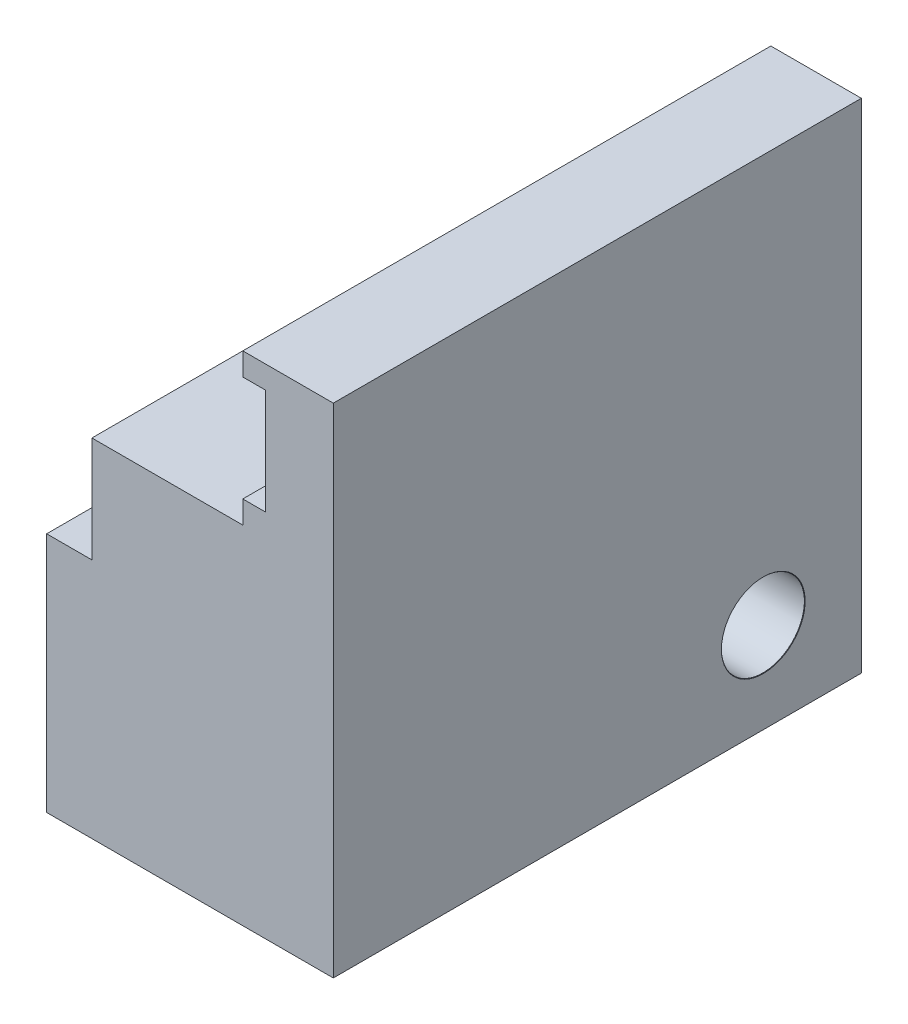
ISO-10303-21;
HEADER;
FILE_DESCRIPTION(('STEP AP214'),'2;1');
FILE_NAME('part.step','',(''),(''),'','','');
FILE_SCHEMA(('AUTOMOTIVE_DESIGN { 1 0 10303 214 1 1 1 1 }'));
ENDSEC;
DATA;
#1=APPLICATION_CONTEXT('core data for automotive mechanical design processes');
#2=APPLICATION_PROTOCOL_DEFINITION('international standard','automotive_design',2000,#1);
#3=PRODUCT_CONTEXT('',#1,'mechanical');
#4=PRODUCT('Part','Part','',(#3));
#5=PRODUCT_RELATED_PRODUCT_CATEGORY('part','',(#4));
#6=PRODUCT_DEFINITION_FORMATION('','',#4);
#7=PRODUCT_DEFINITION_CONTEXT('part definition',#1,'design');
#8=PRODUCT_DEFINITION('design','',#6,#7);
#9=PRODUCT_DEFINITION_SHAPE('','',#8);
#10=(LENGTH_UNIT() NAMED_UNIT(*) SI_UNIT(.MILLI.,.METRE.));
#11=(NAMED_UNIT(*) PLANE_ANGLE_UNIT() SI_UNIT($,.RADIAN.));
#12=(NAMED_UNIT(*) SI_UNIT($,.STERADIAN.) SOLID_ANGLE_UNIT());
#13=UNCERTAINTY_MEASURE_WITH_UNIT(LENGTH_MEASURE(1.E-05),#10,'distance_accuracy_value','');
#14=(GEOMETRIC_REPRESENTATION_CONTEXT(3) GLOBAL_UNCERTAINTY_ASSIGNED_CONTEXT((#13)) GLOBAL_UNIT_ASSIGNED_CONTEXT((#10,
#11,#12)) REPRESENTATION_CONTEXT('',''));
#15=CARTESIAN_POINT('',(0.,0.,0.));
#16=DIRECTION('',(0.,0.,1.));
#17=DIRECTION('',(1.,0.,0.));
#18=AXIS2_PLACEMENT_3D('',#15,#16,#17);
#19=CARTESIAN_POINT('',(-159.,218.05458814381,35.));
#20=DIRECTION('',(-1.,0.,0.));
#21=DIRECTION('',(0.,0.,1.));
#22=AXIS2_PLACEMENT_3D('',#19,#20,#21);
#23=PLANE('',#22);
#24=CARTESIAN_POINT('',(-159.,224.05458814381,6.5));
#25=DIRECTION('',(-1.,0.,0.));
#26=DIRECTION('',(0.,0.,1.));
#27=AXIS2_PLACEMENT_3D('',#24,#25,#26);
#28=CIRCLE('',#27,2.775);
#29=CARTESIAN_POINT('',(-159.,224.05458814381,9.275));
#30=VERTEX_POINT('',#29);
#31=EDGE_CURVE('E249',#30,#30,#28,.T.);
#32=ORIENTED_EDGE('',*,*,#31,.T.);
#33=EDGE_LOOP('',(#32));
#34=FACE_BOUND('',#33,.T.);
#35=DIRECTION('',(0.,1.,0.));
#36=VECTOR('',#35,1.);
#37=CARTESIAN_POINT('',(-159.,218.05458814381,0.));
#38=LINE('',#37,#36);
#39=CARTESIAN_POINT('',(-159.,218.05458814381,0.));
#40=VERTEX_POINT('',#39);
#41=CARTESIAN_POINT('',(-159.,251.054588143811,0.));
#42=VERTEX_POINT('',#41);
#43=EDGE_CURVE('E163',#40,#42,#38,.T.);
#44=ORIENTED_EDGE('',*,*,#43,.T.);
#45=DIRECTION('',(0.,0.,-1.));
#46=VECTOR('',#45,1.);
#47=CARTESIAN_POINT('',(-159.,251.054588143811,35.));
#48=LINE('',#47,#46);
#49=CARTESIAN_POINT('',(-159.,251.054588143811,35.));
#50=VERTEX_POINT('',#49);
#51=EDGE_CURVE('E11',#50,#42,#48,.T.);
#52=ORIENTED_EDGE('',*,*,#51,.F.);
#53=DIRECTION('',(0.,1.,0.));
#54=VECTOR('',#53,1.);
#55=CARTESIAN_POINT('',(-159.,218.05458814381,35.));
#56=LINE('',#55,#54);
#57=CARTESIAN_POINT('',(-159.,218.05458814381,35.));
#58=VERTEX_POINT('',#57);
#59=EDGE_CURVE('E171',#58,#50,#56,.T.);
#60=ORIENTED_EDGE('',*,*,#59,.F.);
#61=DIRECTION('',(0.,0.,-1.));
#62=VECTOR('',#61,1.);
#63=CARTESIAN_POINT('',(-159.,218.05458814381,35.));
#64=LINE('',#63,#62);
#65=EDGE_CURVE('E184',#58,#40,#64,.T.);
#66=ORIENTED_EDGE('',*,*,#65,.T.);
#67=EDGE_LOOP('',(#44,#52,#60,#66));
#68=FACE_BOUND('',#67,.T.);
#69=ADVANCED_FACE('F16',(#34,#68),#23,.F.);
#70=CARTESIAN_POINT('',(-159.,251.054588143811,35.));
#71=DIRECTION('',(0.,-1.,0.));
#72=DIRECTION('',(0.,0.,-1.));
#73=AXIS2_PLACEMENT_3D('',#70,#71,#72);
#74=PLANE('',#73);
#75=DIRECTION('',(-1.,0.,0.));
#76=VECTOR('',#75,1.);
#77=CARTESIAN_POINT('',(-159.,251.054588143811,0.));
#78=LINE('',#77,#76);
#79=CARTESIAN_POINT('',(-165.,251.054588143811,0.));
#80=VERTEX_POINT('',#79);
#81=EDGE_CURVE('E187',#42,#80,#78,.T.);
#82=ORIENTED_EDGE('',*,*,#81,.T.);
#83=DIRECTION('',(0.,0.,-1.));
#84=VECTOR('',#83,1.);
#85=CARTESIAN_POINT('',(-165.,251.054588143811,35.));
#86=LINE('',#85,#84);
#87=CARTESIAN_POINT('',(-165.,251.054588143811,35.));
#88=VERTEX_POINT('',#87);
#89=EDGE_CURVE('E23',#88,#80,#86,.T.);
#90=ORIENTED_EDGE('',*,*,#89,.F.);
#91=DIRECTION('',(-1.,0.,0.));
#92=VECTOR('',#91,1.);
#93=CARTESIAN_POINT('',(-159.,251.054588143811,35.));
#94=LINE('',#93,#92);
#95=EDGE_CURVE('E174',#50,#88,#94,.T.);
#96=ORIENTED_EDGE('',*,*,#95,.F.);
#97=ORIENTED_EDGE('',*,*,#51,.T.);
#98=EDGE_LOOP('',(#82,#90,#96,#97));
#99=FACE_BOUND('',#98,.T.);
#100=ADVANCED_FACE('F219',(#99),#74,.F.);
#101=CARTESIAN_POINT('',(-165.,251.054588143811,35.));
#102=DIRECTION('',(1.,0.,0.));
#103=DIRECTION('',(0.,0.,-1.));
#104=AXIS2_PLACEMENT_3D('',#101,#102,#103);
#105=PLANE('',#104);
#106=DIRECTION('',(0.,-1.,0.));
#107=VECTOR('',#106,1.);
#108=CARTESIAN_POINT('',(-165.,251.054588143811,0.));
#109=LINE('',#108,#107);
#110=CARTESIAN_POINT('',(-165.,249.55458814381,0.));
#111=VERTEX_POINT('',#110);
#112=EDGE_CURVE('E189',#80,#111,#109,.T.);
#113=ORIENTED_EDGE('',*,*,#112,.T.);
#114=DIRECTION('',(0.,0.,-1.));
#115=VECTOR('',#114,1.);
#116=CARTESIAN_POINT('',(-165.,249.55458814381,35.));
#117=LINE('',#116,#115);
#118=CARTESIAN_POINT('',(-165.,249.55458814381,35.));
#119=VERTEX_POINT('',#118);
#120=EDGE_CURVE('E38',#119,#111,#117,.T.);
#121=ORIENTED_EDGE('',*,*,#120,.F.);
#122=DIRECTION('',(0.,-1.,0.));
#123=VECTOR('',#122,1.);
#124=CARTESIAN_POINT('',(-165.,251.054588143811,35.));
#125=LINE('',#124,#123);
#126=EDGE_CURVE('E177',#88,#119,#125,.T.);
#127=ORIENTED_EDGE('',*,*,#126,.F.);
#128=ORIENTED_EDGE('',*,*,#89,.T.);
#129=EDGE_LOOP('',(#113,#121,#127,#128));
#130=FACE_BOUND('',#129,.T.);
#131=ADVANCED_FACE('F204',(#130),#105,.F.);
#132=CARTESIAN_POINT('',(-178.,218.05458814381,35.));
#133=DIRECTION('',(1.,0.,0.));
#134=DIRECTION('',(0.,0.,-1.));
#135=AXIS2_PLACEMENT_3D('',#132,#133,#134);
#136=PLANE('',#135);
#137=CARTESIAN_POINT('',(-178.,224.05458814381,6.5));
#138=DIRECTION('',(-1.,0.,0.));
#139=DIRECTION('',(0.,0.,1.));
#140=AXIS2_PLACEMENT_3D('',#137,#138,#139);
#141=CIRCLE('',#140,5.025);
#142=CARTESIAN_POINT('',(-178.,224.05458814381,11.525));
#143=VERTEX_POINT('',#142);
#144=EDGE_CURVE('E251',#143,#143,#141,.T.);
#145=ORIENTED_EDGE('',*,*,#144,.F.);
#146=EDGE_LOOP('',(#145));
#147=FACE_BOUND('',#146,.T.);
#148=DIRECTION('',(0.,-1.,0.));
#149=VECTOR('',#148,1.);
#150=CARTESIAN_POINT('',(-178.,218.05458814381,35.));
#151=LINE('',#150,#149);
#152=CARTESIAN_POINT('',(-178.,234.05458814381,35.));
#153=VERTEX_POINT('',#152);
#154=CARTESIAN_POINT('',(-178.,218.05458814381,35.));
#155=VERTEX_POINT('',#154);
#156=EDGE_CURVE('E180',#153,#155,#151,.T.);
#157=ORIENTED_EDGE('',*,*,#156,.F.);
#158=DIRECTION('',(0.,0.,-1.));
#159=VECTOR('',#158,1.);
#160=CARTESIAN_POINT('',(-178.,234.05458814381,35.));
#161=LINE('',#160,#159);
#162=CARTESIAN_POINT('',(-178.,234.05458814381,0.));
#163=VERTEX_POINT('',#162);
#164=EDGE_CURVE('E110',#153,#163,#161,.T.);
#165=ORIENTED_EDGE('',*,*,#164,.T.);
#166=DIRECTION('',(0.,-1.,0.));
#167=VECTOR('',#166,1.);
#168=CARTESIAN_POINT('',(-178.,218.05458814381,0.));
#169=LINE('',#168,#167);
#170=CARTESIAN_POINT('',(-178.,218.05458814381,0.));
#171=VERTEX_POINT('',#170);
#172=EDGE_CURVE('E192',#163,#171,#169,.T.);
#173=ORIENTED_EDGE('',*,*,#172,.T.);
#174=DIRECTION('',(0.,0.,-1.));
#175=VECTOR('',#174,1.);
#176=CARTESIAN_POINT('',(-178.,218.05458814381,35.));
#177=LINE('',#176,#175);
#178=EDGE_CURVE('E197',#155,#171,#177,.T.);
#179=ORIENTED_EDGE('',*,*,#178,.F.);
#180=EDGE_LOOP('',(#157,#165,#173,#179));
#181=FACE_BOUND('',#180,.T.);
#182=ADVANCED_FACE('F228',(#147,#181),#136,.F.);
#183=CARTESIAN_POINT('',(-159.,218.05458814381,35.));
#184=DIRECTION('',(0.,1.,0.));
#185=DIRECTION('',(0.,0.,1.));
#186=AXIS2_PLACEMENT_3D('',#183,#184,#185);
#187=PLANE('',#186);
#188=DIRECTION('',(1.,0.,0.));
#189=VECTOR('',#188,1.);
#190=CARTESIAN_POINT('',(-159.,218.05458814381,0.));
#191=LINE('',#190,#189);
#192=EDGE_CURVE('E175',#171,#40,#191,.T.);
#193=ORIENTED_EDGE('',*,*,#192,.T.);
#194=ORIENTED_EDGE('',*,*,#65,.F.);
#195=DIRECTION('',(1.,0.,0.));
#196=VECTOR('',#195,1.);
#197=CARTESIAN_POINT('',(-159.,218.05458814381,35.));
#198=LINE('',#197,#196);
#199=EDGE_CURVE('E182',#155,#58,#198,.T.);
#200=ORIENTED_EDGE('',*,*,#199,.F.);
#201=ORIENTED_EDGE('',*,*,#178,.T.);
#202=EDGE_LOOP('',(#193,#194,#200,#201));
#203=FACE_BOUND('',#202,.T.);
#204=ADVANCED_FACE('F224',(#203),#187,.F.);
#205=CARTESIAN_POINT('',(0.,0.,35.));
#206=DIRECTION('',(0.,0.,1.));
#207=DIRECTION('',(1.,0.,0.));
#208=AXIS2_PLACEMENT_3D('',#205,#206,#207);
#209=PLANE('',#208);
#210=DIRECTION('',(-1.,0.,0.));
#211=VECTOR('',#210,1.);
#212=CARTESIAN_POINT('',(-178.,234.05458814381,35.));
#213=LINE('',#212,#211);
#214=CARTESIAN_POINT('',(-175.,234.05458814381,35.));
#215=VERTEX_POINT('',#214);
#216=EDGE_CURVE('E114',#215,#153,#213,.T.);
#217=ORIENTED_EDGE('',*,*,#216,.T.);
#218=ORIENTED_EDGE('',*,*,#156,.T.);
#219=ORIENTED_EDGE('',*,*,#199,.T.);
#220=ORIENTED_EDGE('',*,*,#59,.T.);
#221=ORIENTED_EDGE('',*,*,#95,.T.);
#222=ORIENTED_EDGE('',*,*,#126,.T.);
#223=DIRECTION('',(1.,0.,0.));
#224=VECTOR('',#223,1.);
#225=CARTESIAN_POINT('',(-163.5,249.55458814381,35.));
#226=LINE('',#225,#224);
#227=CARTESIAN_POINT('',(-163.5,249.55458814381,35.));
#228=VERTEX_POINT('',#227);
#229=EDGE_CURVE('E136',#119,#228,#226,.T.);
#230=ORIENTED_EDGE('',*,*,#229,.T.);
#231=DIRECTION('',(0.,-1.,0.));
#232=VECTOR('',#231,1.);
#233=CARTESIAN_POINT('',(-163.5,242.55458814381,35.));
#234=LINE('',#233,#232);
#235=CARTESIAN_POINT('',(-163.5,242.55458814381,35.));
#236=VERTEX_POINT('',#235);
#237=EDGE_CURVE('E139',#228,#236,#234,.T.);
#238=ORIENTED_EDGE('',*,*,#237,.T.);
#239=DIRECTION('',(-1.,0.,0.));
#240=VECTOR('',#239,1.);
#241=CARTESIAN_POINT('',(-163.5,242.55458814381,35.));
#242=LINE('',#241,#240);
#243=CARTESIAN_POINT('',(-165.,242.55458814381,35.));
#244=VERTEX_POINT('',#243);
#245=EDGE_CURVE('E143',#236,#244,#242,.T.);
#246=ORIENTED_EDGE('',*,*,#245,.T.);
#247=DIRECTION('',(0.,-1.,0.));
#248=VECTOR('',#247,1.);
#249=CARTESIAN_POINT('',(-165.,242.55458814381,35.));
#250=LINE('',#249,#248);
#251=CARTESIAN_POINT('',(-165.,241.05458814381,35.));
#252=VERTEX_POINT('',#251);
#253=EDGE_CURVE('E146',#244,#252,#250,.T.);
#254=ORIENTED_EDGE('',*,*,#253,.T.);
#255=DIRECTION('',(-1.,0.,0.));
#256=VECTOR('',#255,1.);
#257=CARTESIAN_POINT('',(-178.,241.05458814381,35.));
#258=LINE('',#257,#256);
#259=CARTESIAN_POINT('',(-175.,241.05458814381,35.));
#260=VERTEX_POINT('',#259);
#261=EDGE_CURVE('E124',#252,#260,#258,.T.);
#262=ORIENTED_EDGE('',*,*,#261,.T.);
#263=DIRECTION('',(0.,-1.,0.));
#264=VECTOR('',#263,1.);
#265=CARTESIAN_POINT('',(-175.,234.05458814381,35.));
#266=LINE('',#265,#264);
#267=EDGE_CURVE('E30',#260,#215,#266,.T.);
#268=ORIENTED_EDGE('',*,*,#267,.T.);
#269=EDGE_LOOP('',(#217,#218,#219,#220,#221,#222,#230,#238,#246,#254,#262,#268));
#270=FACE_BOUND('',#269,.T.);
#271=ADVANCED_FACE('F121',(#270),#209,.T.);
#272=CARTESIAN_POINT('',(0.,0.,0.));
#273=DIRECTION('',(0.,0.,1.));
#274=DIRECTION('',(1.,0.,0.));
#275=AXIS2_PLACEMENT_3D('',#272,#273,#274);
#276=PLANE('',#275);
#277=ORIENTED_EDGE('',*,*,#172,.F.);
#278=DIRECTION('',(-1.,0.,0.));
#279=VECTOR('',#278,1.);
#280=CARTESIAN_POINT('',(-178.,234.05458814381,0.));
#281=LINE('',#280,#279);
#282=CARTESIAN_POINT('',(-175.,234.05458814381,0.));
#283=VERTEX_POINT('',#282);
#284=EDGE_CURVE('E125',#283,#163,#281,.T.);
#285=ORIENTED_EDGE('',*,*,#284,.F.);
#286=DIRECTION('',(0.,-1.,0.));
#287=VECTOR('',#286,1.);
#288=CARTESIAN_POINT('',(-175.,234.05458814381,0.));
#289=LINE('',#288,#287);
#290=CARTESIAN_POINT('',(-175.,241.05458814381,0.));
#291=VERTEX_POINT('',#290);
#292=EDGE_CURVE('E107',#291,#283,#289,.T.);
#293=ORIENTED_EDGE('',*,*,#292,.F.);
#294=DIRECTION('',(-1.,0.,0.));
#295=VECTOR('',#294,1.);
#296=CARTESIAN_POINT('',(-178.,241.05458814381,0.));
#297=LINE('',#296,#295);
#298=CARTESIAN_POINT('',(-165.,241.05458814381,0.));
#299=VERTEX_POINT('',#298);
#300=EDGE_CURVE('E140',#299,#291,#297,.T.);
#301=ORIENTED_EDGE('',*,*,#300,.F.);
#302=DIRECTION('',(0.,-1.,0.));
#303=VECTOR('',#302,1.);
#304=CARTESIAN_POINT('',(-165.,242.55458814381,0.));
#305=LINE('',#304,#303);
#306=CARTESIAN_POINT('',(-165.,242.55458814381,0.));
#307=VERTEX_POINT('',#306);
#308=EDGE_CURVE('E156',#307,#299,#305,.T.);
#309=ORIENTED_EDGE('',*,*,#308,.F.);
#310=DIRECTION('',(-1.,0.,0.));
#311=VECTOR('',#310,1.);
#312=CARTESIAN_POINT('',(-163.5,242.55458814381,0.));
#313=LINE('',#312,#311);
#314=CARTESIAN_POINT('',(-163.5,242.55458814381,0.));
#315=VERTEX_POINT('',#314);
#316=EDGE_CURVE('E153',#315,#307,#313,.T.);
#317=ORIENTED_EDGE('',*,*,#316,.F.);
#318=DIRECTION('',(0.,-1.,0.));
#319=VECTOR('',#318,1.);
#320=CARTESIAN_POINT('',(-163.5,242.55458814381,0.));
#321=LINE('',#320,#319);
#322=CARTESIAN_POINT('',(-163.5,249.55458814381,0.));
#323=VERTEX_POINT('',#322);
#324=EDGE_CURVE('E150',#323,#315,#321,.T.);
#325=ORIENTED_EDGE('',*,*,#324,.F.);
#326=DIRECTION('',(1.,0.,0.));
#327=VECTOR('',#326,1.);
#328=CARTESIAN_POINT('',(-163.5,249.55458814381,0.));
#329=LINE('',#328,#327);
#330=EDGE_CURVE('E133',#111,#323,#329,.T.);
#331=ORIENTED_EDGE('',*,*,#330,.F.);
#332=ORIENTED_EDGE('',*,*,#112,.F.);
#333=ORIENTED_EDGE('',*,*,#81,.F.);
#334=ORIENTED_EDGE('',*,*,#43,.F.);
#335=ORIENTED_EDGE('',*,*,#192,.F.);
#336=EDGE_LOOP('',(#277,#285,#293,#301,#309,#317,#325,#331,#332,#333,#334,#335));
#337=FACE_BOUND('',#336,.T.);
#338=ADVANCED_FACE('F208',(#337),#276,.F.);
#339=CARTESIAN_POINT('',(-178.,241.05458814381,35.));
#340=DIRECTION('',(0.,-1.,0.));
#341=DIRECTION('',(0.,0.,-1.));
#342=AXIS2_PLACEMENT_3D('',#339,#340,#341);
#343=PLANE('',#342);
#344=ORIENTED_EDGE('',*,*,#300,.T.);
#345=DIRECTION('',(0.,0.,-1.));
#346=VECTOR('',#345,1.);
#347=CARTESIAN_POINT('',(-175.,241.05458814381,35.));
#348=LINE('',#347,#346);
#349=EDGE_CURVE('E111',#260,#291,#348,.T.);
#350=ORIENTED_EDGE('',*,*,#349,.F.);
#351=ORIENTED_EDGE('',*,*,#261,.F.);
#352=DIRECTION('',(0.,0.,-1.));
#353=VECTOR('',#352,1.);
#354=CARTESIAN_POINT('',(-165.,241.05458814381,35.));
#355=LINE('',#354,#353);
#356=EDGE_CURVE('E161',#252,#299,#355,.T.);
#357=ORIENTED_EDGE('',*,*,#356,.T.);
#358=EDGE_LOOP('',(#344,#350,#351,#357));
#359=FACE_BOUND('',#358,.T.);
#360=ADVANCED_FACE('F292',(#359),#343,.F.);
#361=CARTESIAN_POINT('',(-165.,242.55458814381,35.));
#362=DIRECTION('',(1.,0.,0.));
#363=DIRECTION('',(0.,0.,-1.));
#364=AXIS2_PLACEMENT_3D('',#361,#362,#363);
#365=PLANE('',#364);
#366=ORIENTED_EDGE('',*,*,#308,.T.);
#367=ORIENTED_EDGE('',*,*,#356,.F.);
#368=ORIENTED_EDGE('',*,*,#253,.F.);
#369=DIRECTION('',(0.,0.,-1.));
#370=VECTOR('',#369,1.);
#371=CARTESIAN_POINT('',(-165.,242.55458814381,35.));
#372=LINE('',#371,#370);
#373=EDGE_CURVE('E164',#244,#307,#372,.T.);
#374=ORIENTED_EDGE('',*,*,#373,.T.);
#375=EDGE_LOOP('',(#366,#367,#368,#374));
#376=FACE_BOUND('',#375,.T.);
#377=ADVANCED_FACE('F295',(#376),#365,.F.);
#378=CARTESIAN_POINT('',(-163.5,242.55458814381,35.));
#379=DIRECTION('',(0.,-1.,0.));
#380=DIRECTION('',(0.,0.,-1.));
#381=AXIS2_PLACEMENT_3D('',#378,#379,#380);
#382=PLANE('',#381);
#383=ORIENTED_EDGE('',*,*,#316,.T.);
#384=ORIENTED_EDGE('',*,*,#373,.F.);
#385=ORIENTED_EDGE('',*,*,#245,.F.);
#386=DIRECTION('',(0.,0.,-1.));
#387=VECTOR('',#386,1.);
#388=CARTESIAN_POINT('',(-163.5,242.55458814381,35.));
#389=LINE('',#388,#387);
#390=EDGE_CURVE('E166',#236,#315,#389,.T.);
#391=ORIENTED_EDGE('',*,*,#390,.T.);
#392=EDGE_LOOP('',(#383,#384,#385,#391));
#393=FACE_BOUND('',#392,.T.);
#394=ADVANCED_FACE('F299',(#393),#382,.F.);
#395=CARTESIAN_POINT('',(-163.5,242.55458814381,35.));
#396=DIRECTION('',(1.,0.,0.));
#397=DIRECTION('',(0.,0.,-1.));
#398=AXIS2_PLACEMENT_3D('',#395,#396,#397);
#399=PLANE('',#398);
#400=ORIENTED_EDGE('',*,*,#324,.T.);
#401=ORIENTED_EDGE('',*,*,#390,.F.);
#402=ORIENTED_EDGE('',*,*,#237,.F.);
#403=DIRECTION('',(0.,0.,-1.));
#404=VECTOR('',#403,1.);
#405=CARTESIAN_POINT('',(-163.5,249.55458814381,35.));
#406=LINE('',#405,#404);
#407=EDGE_CURVE('E168',#228,#323,#406,.T.);
#408=ORIENTED_EDGE('',*,*,#407,.T.);
#409=EDGE_LOOP('',(#400,#401,#402,#408));
#410=FACE_BOUND('',#409,.T.);
#411=ADVANCED_FACE('F215',(#410),#399,.F.);
#412=CARTESIAN_POINT('',(-163.5,249.55458814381,35.));
#413=DIRECTION('',(0.,1.,0.));
#414=DIRECTION('',(0.,0.,1.));
#415=AXIS2_PLACEMENT_3D('',#412,#413,#414);
#416=PLANE('',#415);
#417=ORIENTED_EDGE('',*,*,#330,.T.);
#418=ORIENTED_EDGE('',*,*,#407,.F.);
#419=ORIENTED_EDGE('',*,*,#229,.F.);
#420=ORIENTED_EDGE('',*,*,#120,.T.);
#421=EDGE_LOOP('',(#417,#418,#419,#420));
#422=FACE_BOUND('',#421,.T.);
#423=ADVANCED_FACE('F212',(#422),#416,.F.);
#424=CARTESIAN_POINT('',(-178.,234.05458814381,35.));
#425=DIRECTION('',(0.,-1.,0.));
#426=DIRECTION('',(0.,0.,-1.));
#427=AXIS2_PLACEMENT_3D('',#424,#425,#426);
#428=PLANE('',#427);
#429=ORIENTED_EDGE('',*,*,#284,.T.);
#430=ORIENTED_EDGE('',*,*,#164,.F.);
#431=ORIENTED_EDGE('',*,*,#216,.F.);
#432=DIRECTION('',(0.,0.,-1.));
#433=VECTOR('',#432,1.);
#434=CARTESIAN_POINT('',(-175.,234.05458814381,35.));
#435=LINE('',#434,#433);
#436=EDGE_CURVE('E103',#215,#283,#435,.T.);
#437=ORIENTED_EDGE('',*,*,#436,.T.);
#438=EDGE_LOOP('',(#429,#430,#431,#437));
#439=FACE_BOUND('',#438,.T.);
#440=ADVANCED_FACE('F115',(#439),#428,.F.);
#441=CARTESIAN_POINT('',(-175.,234.05458814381,35.));
#442=DIRECTION('',(1.,0.,0.));
#443=DIRECTION('',(0.,0.,-1.));
#444=AXIS2_PLACEMENT_3D('',#441,#442,#443);
#445=PLANE('',#444);
#446=ORIENTED_EDGE('',*,*,#292,.T.);
#447=ORIENTED_EDGE('',*,*,#436,.F.);
#448=ORIENTED_EDGE('',*,*,#267,.F.);
#449=ORIENTED_EDGE('',*,*,#349,.T.);
#450=EDGE_LOOP('',(#446,#447,#448,#449));
#451=FACE_BOUND('',#450,.T.);
#452=ADVANCED_FACE('F105',(#451),#445,.F.);
#453=CARTESIAN_POINT('',(-159.025,224.05458814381,6.5));
#454=DIRECTION('',(1.,0.,0.));
#455=DIRECTION('',(0.,0.,-1.));
#456=AXIS2_PLACEMENT_3D('',#453,#454,#455);
#457=CONICAL_SURFACE('',#456,2.75,0.785398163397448);
#458=ORIENTED_EDGE('',*,*,#31,.F.);
#459=EDGE_LOOP('',(#458));
#460=FACE_BOUND('',#459,.T.);
#461=CARTESIAN_POINT('',(-159.025,224.05458814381,6.5));
#462=DIRECTION('',(-1.,0.,0.));
#463=DIRECTION('',(0.,0.,1.));
#464=AXIS2_PLACEMENT_3D('',#461,#462,#463);
#465=CIRCLE('',#464,2.75);
#466=CARTESIAN_POINT('',(-159.025,224.05458814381,9.25));
#467=VERTEX_POINT('',#466);
#468=EDGE_CURVE('E129',#467,#467,#465,.T.);
#469=ORIENTED_EDGE('',*,*,#468,.T.);
#470=EDGE_LOOP('',(#469));
#471=FACE_BOUND('',#470,.T.);
#472=ADVANCED_FACE('F271',(#460,#471),#457,.F.);
#473=CARTESIAN_POINT('',(-178.,224.05458814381,6.5));
#474=DIRECTION('',(-1.,0.,0.));
#475=DIRECTION('',(0.,0.,1.));
#476=AXIS2_PLACEMENT_3D('',#473,#474,#475);
#477=CYLINDRICAL_SURFACE('',#476,2.75);
#478=ORIENTED_EDGE('',*,*,#468,.F.);
#479=EDGE_LOOP('',(#478));
#480=FACE_BOUND('',#479,.T.);
#481=CARTESIAN_POINT('',(-172.275,224.05458814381,6.5));
#482=DIRECTION('',(-1.,0.,0.));
#483=DIRECTION('',(0.,0.,1.));
#484=AXIS2_PLACEMENT_3D('',#481,#482,#483);
#485=CIRCLE('',#484,2.75);
#486=CARTESIAN_POINT('',(-172.275,224.05458814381,9.25));
#487=VERTEX_POINT('',#486);
#488=EDGE_CURVE('E264',#487,#487,#485,.T.);
#489=ORIENTED_EDGE('',*,*,#488,.T.);
#490=EDGE_LOOP('',(#489));
#491=FACE_BOUND('',#490,.T.);
#492=ADVANCED_FACE('F273',(#480,#491),#477,.F.);
#493=CARTESIAN_POINT('',(-172.3,224.05458814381,6.5));
#494=DIRECTION('',(-1.,0.,0.));
#495=DIRECTION('',(0.,0.,1.));
#496=AXIS2_PLACEMENT_3D('',#493,#494,#495);
#497=CONICAL_SURFACE('',#496,2.775,0.785398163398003);
#498=ORIENTED_EDGE('',*,*,#488,.F.);
#499=EDGE_LOOP('',(#498));
#500=FACE_BOUND('',#499,.T.);
#501=CARTESIAN_POINT('',(-172.3,224.05458814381,6.5));
#502=DIRECTION('',(-1.,0.,0.));
#503=DIRECTION('',(0.,0.,1.));
#504=AXIS2_PLACEMENT_3D('',#501,#502,#503);
#505=CIRCLE('',#504,2.775);
#506=CARTESIAN_POINT('',(-172.3,224.05458814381,9.275));
#507=VERTEX_POINT('',#506);
#508=EDGE_CURVE('E262',#507,#507,#505,.T.);
#509=ORIENTED_EDGE('',*,*,#508,.T.);
#510=EDGE_LOOP('',(#509));
#511=FACE_BOUND('',#510,.T.);
#512=ADVANCED_FACE('F275',(#500,#511),#497,.F.);
#513=CARTESIAN_POINT('',(-172.3,226.82958814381,6.5));
#514=DIRECTION('',(1.,0.,0.));
#515=DIRECTION('',(0.,0.,-1.));
#516=AXIS2_PLACEMENT_3D('',#513,#514,#515);
#517=PLANE('',#516);
#518=ORIENTED_EDGE('',*,*,#508,.F.);
#519=EDGE_LOOP('',(#518));
#520=FACE_BOUND('',#519,.T.);
#521=CARTESIAN_POINT('',(-172.3,224.05458814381,6.5));
#522=DIRECTION('',(-1.,0.,0.));
#523=DIRECTION('',(0.,0.,1.));
#524=AXIS2_PLACEMENT_3D('',#521,#522,#523);
#525=CIRCLE('',#524,5.);
#526=CARTESIAN_POINT('',(-172.3,224.05458814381,11.5));
#527=VERTEX_POINT('',#526);
#528=EDGE_CURVE('E259',#527,#527,#525,.T.);
#529=ORIENTED_EDGE('',*,*,#528,.T.);
#530=EDGE_LOOP('',(#529));
#531=FACE_BOUND('',#530,.T.);
#532=ADVANCED_FACE('F282',(#520,#531),#517,.F.);
#533=CARTESIAN_POINT('',(-178.,224.05458814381,6.5));
#534=DIRECTION('',(-1.,0.,0.));
#535=DIRECTION('',(0.,0.,1.));
#536=AXIS2_PLACEMENT_3D('',#533,#534,#535);
#537=CYLINDRICAL_SURFACE('',#536,5.);
#538=ORIENTED_EDGE('',*,*,#528,.F.);
#539=EDGE_LOOP('',(#538));
#540=FACE_BOUND('',#539,.T.);
#541=CARTESIAN_POINT('',(-177.975,224.05458814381,6.5));
#542=DIRECTION('',(-1.,0.,0.));
#543=DIRECTION('',(0.,0.,1.));
#544=AXIS2_PLACEMENT_3D('',#541,#542,#543);
#545=CIRCLE('',#544,5.);
#546=CARTESIAN_POINT('',(-177.975,224.05458814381,11.5));
#547=VERTEX_POINT('',#546);
#548=EDGE_CURVE('E254',#547,#547,#545,.T.);
#549=ORIENTED_EDGE('',*,*,#548,.T.);
#550=EDGE_LOOP('',(#549));
#551=FACE_BOUND('',#550,.T.);
#552=ADVANCED_FACE('F380',(#540,#551),#537,.F.);
#553=CARTESIAN_POINT('',(-178.,224.05458814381,6.5));
#554=DIRECTION('',(-1.,0.,0.));
#555=DIRECTION('',(0.,0.,1.));
#556=AXIS2_PLACEMENT_3D('',#553,#554,#555);
#557=CONICAL_SURFACE('',#556,5.025,0.785398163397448);
#558=ORIENTED_EDGE('',*,*,#548,.F.);
#559=EDGE_LOOP('',(#558));
#560=FACE_BOUND('',#559,.T.);
#561=ORIENTED_EDGE('',*,*,#144,.T.);
#562=EDGE_LOOP('',(#561));
#563=FACE_BOUND('',#562,.T.);
#564=ADVANCED_FACE('F389',(#560,#563),#557,.F.);
#565=CLOSED_SHELL('',(#69,#100,#131,#182,#204,#271,#338,#360,#377,#394,#411,#423,#440,#452,#472,
#492,#512,#532,#552,#564));
#566=MANIFOLD_SOLID_BREP('B1',#565);
#567=ADVANCED_BREP_SHAPE_REPRESENTATION('',(#18,#566),#14);
#568=SHAPE_DEFINITION_REPRESENTATION(#9,#567);
ENDSEC;
END-ISO-10303-21;
